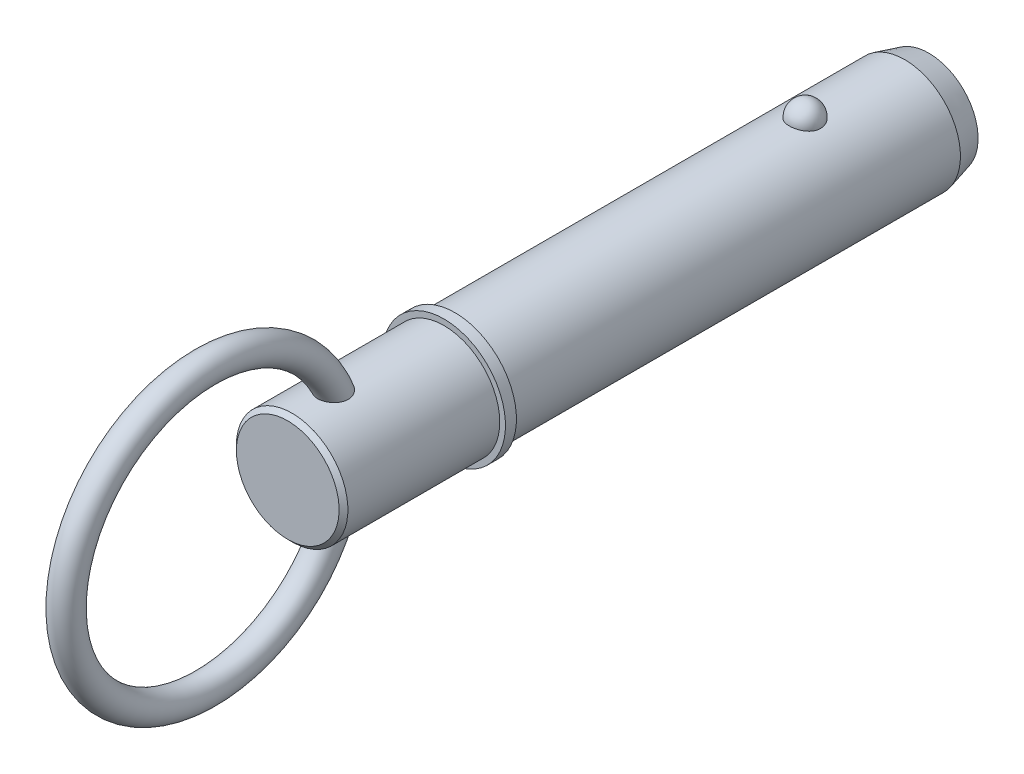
ISO-10303-21;
HEADER;
FILE_DESCRIPTION(('STEP AP214'),'2;1');
FILE_NAME('part.step','',(''),(''),'','','');
FILE_SCHEMA(('AUTOMOTIVE_DESIGN { 1 0 10303 214 1 1 1 1 }'));
ENDSEC;
DATA;
#1=APPLICATION_CONTEXT('core data for automotive mechanical design processes');
#2=APPLICATION_PROTOCOL_DEFINITION('international standard','automotive_design',2000,#1);
#3=PRODUCT_CONTEXT('',#1,'mechanical');
#4=PRODUCT('Part','Part','',(#3));
#5=PRODUCT_RELATED_PRODUCT_CATEGORY('part','',(#4));
#6=PRODUCT_DEFINITION_FORMATION('','',#4);
#7=PRODUCT_DEFINITION_CONTEXT('part definition',#1,'design');
#8=PRODUCT_DEFINITION('design','',#6,#7);
#9=PRODUCT_DEFINITION_SHAPE('','',#8);
#10=(LENGTH_UNIT() NAMED_UNIT(*) SI_UNIT(.MILLI.,.METRE.));
#11=(NAMED_UNIT(*) PLANE_ANGLE_UNIT() SI_UNIT($,.RADIAN.));
#12=(NAMED_UNIT(*) SI_UNIT($,.STERADIAN.) SOLID_ANGLE_UNIT());
#13=UNCERTAINTY_MEASURE_WITH_UNIT(LENGTH_MEASURE(1.E-05),#10,'distance_accuracy_value','');
#14=(GEOMETRIC_REPRESENTATION_CONTEXT(3) GLOBAL_UNCERTAINTY_ASSIGNED_CONTEXT((#13)) GLOBAL_UNIT_ASSIGNED_CONTEXT((#10,
#11,#12)) REPRESENTATION_CONTEXT('',''));
#15=CARTESIAN_POINT('',(0.,0.,0.));
#16=DIRECTION('',(0.,0.,1.));
#17=DIRECTION('',(1.,0.,0.));
#18=AXIS2_PLACEMENT_3D('',#15,#16,#17);
#19=CARTESIAN_POINT('',(0.,0.,76.2));
#20=DIRECTION('',(0.,0.,-1.));
#21=DIRECTION('',(-1.,0.,0.));
#22=AXIS2_PLACEMENT_3D('',#19,#20,#21);
#23=CYLINDRICAL_SURFACE('',#22,12.7);
#24=CARTESIAN_POINT('',(3.52486003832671,12.2010393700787,-3.56));
#25=CARTESIAN_POINT('',(3.52485671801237,12.2010422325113,-3.3610062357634));
#26=CARTESIAN_POINT('',(3.50863187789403,12.2057632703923,-3.16197042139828));
#27=CARTESIAN_POINT('',(3.4441205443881,12.2241207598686,-2.76953945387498));
#28=CARTESIAN_POINT('',(3.39582213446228,12.2377605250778,-2.57614642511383));
#29=CARTESIAN_POINT('',(3.26839193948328,12.2724057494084,-2.20059799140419));
#30=CARTESIAN_POINT('',(3.18927369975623,12.2934079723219,-2.01843769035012));
#31=CARTESIAN_POINT('',(3.00217139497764,12.3404306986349,-1.6703228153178));
#32=CARTESIAN_POINT('',(2.89418796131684,12.3664510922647,-1.50436788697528));
#33=CARTESIAN_POINT('',(2.65144862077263,12.4207616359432,-1.19241975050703));
#34=CARTESIAN_POINT('',(2.51656310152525,12.4490623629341,-1.04652919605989));
#35=CARTESIAN_POINT('',(2.22383249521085,12.5046678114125,-0.779711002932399));
#36=CARTESIAN_POINT('',(2.0659873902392,12.5319725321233,-0.658783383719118));
#37=CARTESIAN_POINT('',(1.73204520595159,12.5824645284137,-0.445586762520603));
#38=CARTESIAN_POINT('',(1.55600183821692,12.6056634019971,-0.353236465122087));
#39=CARTESIAN_POINT('',(1.19021695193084,12.6454411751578,-0.199381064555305));
#40=CARTESIAN_POINT('',(1.00047694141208,12.6620208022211,-0.137872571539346));
#41=CARTESIAN_POINT('',(0.616329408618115,12.6864692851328,-0.0483191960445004));
#42=CARTESIAN_POINT('',(0.422067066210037,12.6944893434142,-0.019692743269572));
#43=CARTESIAN_POINT('',(0.031325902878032,12.7014637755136,0.00524116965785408));
#44=CARTESIAN_POINT('',(-0.165152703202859,12.7004190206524,0.00155173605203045));
#45=CARTESIAN_POINT('',(-0.551780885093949,12.6894611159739,-0.0377454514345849));
#46=CARTESIAN_POINT('',(-0.741980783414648,12.6796749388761,-0.0728962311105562));
#47=CARTESIAN_POINT('',(-1.11361063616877,12.6524544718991,-0.173489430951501));
#48=CARTESIAN_POINT('',(-1.29504043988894,12.6350200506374,-0.238932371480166));
#49=CARTESIAN_POINT('',(-1.64521311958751,12.5942270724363,-0.398772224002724));
#50=CARTESIAN_POINT('',(-1.81387645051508,12.5708347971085,-0.493334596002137));
#51=CARTESIAN_POINT('',(-2.13292959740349,12.5206522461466,-0.708731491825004));
#52=CARTESIAN_POINT('',(-2.28331755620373,12.4938616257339,-0.82956868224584));
#53=CARTESIAN_POINT('',(-2.56470285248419,12.4391828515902,-1.09687144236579));
#54=CARTESIAN_POINT('',(-2.69527522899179,12.4112835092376,-1.24378221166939));
#55=CARTESIAN_POINT('',(-2.93023079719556,12.3579248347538,-1.55763192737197));
#56=CARTESIAN_POINT('',(-3.03461212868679,12.3324656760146,-1.72457229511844));
#57=CARTESIAN_POINT('',(-3.21564423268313,12.2865167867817,-2.07598316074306));
#58=CARTESIAN_POINT('',(-3.29196222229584,12.2660875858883,-2.26063321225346));
#59=CARTESIAN_POINT('',(-3.41323771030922,12.2328979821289,-2.64061334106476));
#60=CARTESIAN_POINT('',(-3.45819611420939,12.2201373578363,-2.83594310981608));
#61=CARTESIAN_POINT('',(-3.51550038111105,12.2037762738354,-3.2308649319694));
#62=CARTESIAN_POINT('',(-3.5279827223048,12.200137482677,-3.43043558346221));
#63=CARTESIAN_POINT('',(-3.52041430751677,12.2023234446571,-3.82890252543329));
#64=CARTESIAN_POINT('',(-3.50036443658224,12.2081479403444,-4.02779883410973));
#65=CARTESIAN_POINT('',(-3.42842010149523,12.2285446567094,-4.41824213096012));
#66=CARTESIAN_POINT('',(-3.37668525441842,12.243073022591,-4.6098208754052));
#67=CARTESIAN_POINT('',(-3.24279085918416,12.2792134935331,-4.98132360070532));
#68=CARTESIAN_POINT('',(-3.16063009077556,12.300825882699,-5.16124711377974));
#69=CARTESIAN_POINT('',(-2.96738224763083,12.3488691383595,-5.5054285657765));
#70=CARTESIAN_POINT('',(-2.85613997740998,12.3753256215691,-5.66959579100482));
#71=CARTESIAN_POINT('',(-2.60773241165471,12.4300386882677,-5.97665065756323));
#72=CARTESIAN_POINT('',(-2.47056612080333,12.458295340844,-6.11953748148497));
#73=CARTESIAN_POINT('',(-2.17327999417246,12.5135827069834,-6.38059312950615));
#74=CARTESIAN_POINT('',(-2.01307652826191,12.5406084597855,-6.49866785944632));
#75=CARTESIAN_POINT('',(-1.67442544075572,12.5902954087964,-6.70609314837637));
#76=CARTESIAN_POINT('',(-1.49597909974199,12.6129569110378,-6.79544572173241));
#77=CARTESIAN_POINT('',(-1.12819666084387,12.6511224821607,-6.94192787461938));
#78=CARTESIAN_POINT('',(-0.939024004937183,12.666712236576,-6.99944518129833));
#79=CARTESIAN_POINT('',(-0.553267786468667,12.6894125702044,-7.08227444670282));
#80=CARTESIAN_POINT('',(-0.356685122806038,12.6965241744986,-7.10759029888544));
#81=CARTESIAN_POINT('',(0.0343320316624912,12.7014305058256,-7.12510946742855));
#82=CARTESIAN_POINT('',(0.22873699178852,12.6993986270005,-7.11792901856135));
#83=CARTESIAN_POINT('',(0.613493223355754,12.6866339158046,-7.07206766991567));
#84=CARTESIAN_POINT('',(0.803844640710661,12.6759013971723,-7.03338790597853));
#85=CARTESIAN_POINT('',(1.17440741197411,12.6469443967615,-6.925834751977));
#86=CARTESIAN_POINT('',(1.35465462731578,12.6287486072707,-6.85707692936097));
#87=CARTESIAN_POINT('',(1.70092526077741,12.5867908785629,-6.69128257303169));
#88=CARTESIAN_POINT('',(1.86694777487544,12.5630285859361,-6.59424424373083));
#89=CARTESIAN_POINT('',(2.18289085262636,12.5120350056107,-6.3727748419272));
#90=CARTESIAN_POINT('',(2.33252391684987,12.4847559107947,-6.24794475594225));
#91=CARTESIAN_POINT('',(2.60889724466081,12.4299457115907,-5.97511730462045));
#92=CARTESIAN_POINT('',(2.73563353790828,12.4024145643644,-5.82711592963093));
#93=CARTESIAN_POINT('',(2.96505559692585,12.3495984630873,-5.50912267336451));
#94=CARTESIAN_POINT('',(3.06728335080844,12.3243610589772,-5.33879227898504));
#95=CARTESIAN_POINT('',(3.24218794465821,12.2795120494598,-4.98295005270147));
#96=CARTESIAN_POINT('',(3.31487538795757,12.2598984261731,-4.79744369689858));
#97=CARTESIAN_POINT('',(3.42255689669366,12.2302435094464,-4.43775244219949));
#98=CARTESIAN_POINT('',(3.46085292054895,12.2193780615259,-4.264615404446));
#99=CARTESIAN_POINT('',(3.5120056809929,12.2047747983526,-3.9143299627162));
#100=CARTESIAN_POINT('',(3.52486299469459,12.2010368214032,-3.73718164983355));
#101=CARTESIAN_POINT('',(3.52486003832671,12.2010393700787,-3.56));
#102=B_SPLINE_CURVE_WITH_KNOTS('',3,(#24,#25,#26,#27,#28,#29,#30,#31,#32,#33,#34,#35,#36,#37,
#38,#39,#40,#41,#42,#43,#44,#45,#46,#47,#48,#49,#50,#51,#52,#53,#54,#55,#56,#57,#58,#59,#60,#61,
#62,#63,#64,#65,#66,#67,#68,#69,#70,#71,#72,#73,#74,#75,#76,#77,#78,#79,#80,#81,#82,#83,#84,#85,
#86,#87,#88,#89,#90,#91,#92,#93,#94,#95,#96,#97,#98,#99,#100,#101),.UNSPECIFIED.,.T.,.F.,(4,2,2,
2,2,2,2,2,2,2,2,2,2,2,2,2,2,2,2,2,2,2,2,2,2,2,2,2,2,2,2,2,2,2,2,2,2,2,4),(0.,0.596344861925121,
1.19291141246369,1.78921606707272,2.38550767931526,2.98474477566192,3.58398233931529,
4.18149920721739,4.77895038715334,5.36566361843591,5.95232045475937,6.53059198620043,
7.10887345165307,7.6905033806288,8.27219236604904,8.86498552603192,9.45782077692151,
10.0574751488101,10.6571122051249,11.2542252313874,11.8513220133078,12.4454353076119,
13.0395724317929,13.636947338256,14.2343451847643,14.8339691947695,15.4335511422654,
16.0256602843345,16.6176978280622,17.1985559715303,17.7793931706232,18.3580179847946,
18.9366795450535,19.5242567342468,20.1119357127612,20.7098642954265,21.3075780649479,
21.8385683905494,22.3695466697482),.UNSPECIFIED.);
#103=CARTESIAN_POINT('',(3.52486003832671,12.2010393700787,-3.56));
#104=VERTEX_POINT('',#103);
#105=EDGE_CURVE('E103',#104,#104,#102,.T.);
#106=ORIENTED_EDGE('',*,*,#105,.T.);
#107=EDGE_LOOP('',(#106));
#108=FACE_BOUND('',#107,.T.);
#109=CARTESIAN_POINT('',(0.,0.,-26.2500000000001));
#110=DIRECTION('',(0.,0.,-1.));
#111=DIRECTION('',(-1.,0.,0.));
#112=AXIS2_PLACEMENT_3D('',#109,#110,#111);
#113=CIRCLE('',#112,12.7);
#114=CARTESIAN_POINT('',(-12.7,0.,-26.2500000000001));
#115=VERTEX_POINT('',#114);
#116=EDGE_CURVE('E111',#115,#115,#113,.F.);
#117=ORIENTED_EDGE('',*,*,#116,.T.);
#118=EDGE_LOOP('',(#117));
#119=FACE_BOUND('',#118,.T.);
#120=CARTESIAN_POINT('',(0.,0.,76.2));
#121=DIRECTION('',(0.,0.,1.));
#122=DIRECTION('',(1.,0.,0.));
#123=AXIS2_PLACEMENT_3D('',#120,#121,#122);
#124=CIRCLE('',#123,12.7);
#125=CARTESIAN_POINT('',(12.7,0.,76.2));
#126=VERTEX_POINT('',#125);
#127=EDGE_CURVE('E109',#126,#126,#124,.T.);
#128=ORIENTED_EDGE('',*,*,#127,.F.);
#129=EDGE_LOOP('',(#128));
#130=FACE_BOUND('',#129,.T.);
#131=ADVANCED_FACE('F39',(#108,#119,#130),#23,.T.);
#132=CARTESIAN_POINT('',(0.,0.,-31.75));
#133=DIRECTION('',(0.,0.,-1.));
#134=DIRECTION('',(-1.,0.,0.));
#135=AXIS2_PLACEMENT_3D('',#132,#133,#134);
#136=PLANE('',#135);
#137=CARTESIAN_POINT('',(0.,0.,-31.75));
#138=DIRECTION('',(0.,0.,-1.));
#139=DIRECTION('',(-1.,0.,0.));
#140=AXIS2_PLACEMENT_3D('',#137,#138,#139);
#141=CIRCLE('',#140,11.2262794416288);
#142=CARTESIAN_POINT('',(-11.2262794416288,0.,-31.75));
#143=VERTEX_POINT('',#142);
#144=EDGE_CURVE('E142',#143,#143,#141,.T.);
#145=ORIENTED_EDGE('',*,*,#144,.T.);
#146=EDGE_LOOP('',(#145));
#147=FACE_BOUND('',#146,.T.);
#148=ADVANCED_FACE('F89',(#147),#136,.T.);
#149=CARTESIAN_POINT('',(0.,0.,-31.75));
#150=DIRECTION('',(0.,0.,1.));
#151=DIRECTION('',(1.,0.,0.));
#152=AXIS2_PLACEMENT_3D('',#149,#150,#151);
#153=CONICAL_SURFACE('',#152,11.2262794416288,0.261799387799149);
#154=ORIENTED_EDGE('',*,*,#116,.F.);
#155=EDGE_LOOP('',(#154));
#156=FACE_BOUND('',#155,.T.);
#157=ORIENTED_EDGE('',*,*,#144,.F.);
#158=EDGE_LOOP('',(#157));
#159=FACE_BOUND('',#158,.T.);
#160=ADVANCED_FACE('F95',(#156,#159),#153,.T.);
#161=CARTESIAN_POINT('',(0.,12.7,-3.56));
#162=DIRECTION('',(0.,1.,0.));
#163=DIRECTION('',(0.,0.,1.));
#164=AXIS2_PLACEMENT_3D('',#161,#162,#163);
#165=SPHERICAL_SURFACE('',#164,3.56);
#166=ORIENTED_EDGE('',*,*,#105,.F.);
#167=EDGE_LOOP('',(#166));
#168=FACE_BOUND('',#167,.T.);
#169=ADVANCED_FACE('F114',(#168),#165,.T.);
#170=CARTESIAN_POINT('',(0.,0.,76.2));
#171=DIRECTION('',(0.,0.,-1.));
#172=DIRECTION('',(-1.,0.,0.));
#173=AXIS2_PLACEMENT_3D('',#170,#171,#172);
#174=PLANE('',#173);
#175=ORIENTED_EDGE('',*,*,#127,.T.);
#176=EDGE_LOOP('',(#175));
#177=FACE_BOUND('',#176,.T.);
#178=CARTESIAN_POINT('',(0.,0.,76.2));
#179=DIRECTION('',(0.,0.,-1.));
#180=DIRECTION('',(-1.,0.,0.));
#181=AXIS2_PLACEMENT_3D('',#178,#179,#180);
#182=CIRCLE('',#181,14.);
#183=CARTESIAN_POINT('',(-14.,0.,76.2));
#184=VERTEX_POINT('',#183);
#185=EDGE_CURVE('E110',#184,#184,#182,.T.);
#186=ORIENTED_EDGE('',*,*,#185,.T.);
#187=EDGE_LOOP('',(#186));
#188=FACE_BOUND('',#187,.T.);
#189=ADVANCED_FACE('F118',(#177,#188),#174,.T.);
#190=CARTESIAN_POINT('',(0.,0.,33.7287874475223));
#191=DIRECTION('',(0.,0.,-1.));
#192=DIRECTION('',(-1.,0.,0.));
#193=AXIS2_PLACEMENT_3D('',#190,#191,#192);
#194=CYLINDRICAL_SURFACE('',#193,14.);
#195=CARTESIAN_POINT('',(0.,0.,78.7));
#196=DIRECTION('',(0.,0.,-1.));
#197=DIRECTION('',(-1.,0.,0.));
#198=AXIS2_PLACEMENT_3D('',#195,#196,#197);
#199=CIRCLE('',#198,14.);
#200=CARTESIAN_POINT('',(-14.,0.,78.7));
#201=VERTEX_POINT('',#200);
#202=EDGE_CURVE('E135',#201,#201,#199,.T.);
#203=ORIENTED_EDGE('',*,*,#202,.T.);
#204=EDGE_LOOP('',(#203));
#205=FACE_BOUND('',#204,.T.);
#206=ORIENTED_EDGE('',*,*,#185,.F.);
#207=EDGE_LOOP('',(#206));
#208=FACE_BOUND('',#207,.T.);
#209=ADVANCED_FACE('F122',(#205,#208),#194,.T.);
#210=CARTESIAN_POINT('',(0.,14.,78.7));
#211=DIRECTION('',(0.,0.,1.));
#212=DIRECTION('',(1.,0.,0.));
#213=AXIS2_PLACEMENT_3D('',#210,#211,#212);
#214=PLANE('',#213);
#215=CARTESIAN_POINT('',(0.,0.,78.7));
#216=DIRECTION('',(0.,0.,1.));
#217=DIRECTION('',(1.,0.,0.));
#218=AXIS2_PLACEMENT_3D('',#215,#216,#217);
#219=CIRCLE('',#218,12.7);
#220=CARTESIAN_POINT('',(12.7,0.,78.7));
#221=VERTEX_POINT('',#220);
#222=EDGE_CURVE('E113',#221,#221,#219,.T.);
#223=ORIENTED_EDGE('',*,*,#222,.F.);
#224=EDGE_LOOP('',(#223));
#225=FACE_BOUND('',#224,.T.);
#226=ORIENTED_EDGE('',*,*,#202,.F.);
#227=EDGE_LOOP('',(#226));
#228=FACE_BOUND('',#227,.T.);
#229=ADVANCED_FACE('F86',(#225,#228),#214,.T.);
#230=CARTESIAN_POINT('',(0.,0.,114.3));
#231=DIRECTION('',(0.,0.,-1.));
#232=DIRECTION('',(-1.,0.,0.));
#233=AXIS2_PLACEMENT_3D('',#230,#231,#232);
#234=CYLINDRICAL_SURFACE('',#233,12.7);
#235=CARTESIAN_POINT('',(-1.22892607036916,-12.6404011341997,100.67119395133));
#236=CARTESIAN_POINT('',(-1.06119922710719,-12.6567092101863,100.604004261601));
#237=CARTESIAN_POINT('',(-0.887663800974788,-12.6701810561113,100.550792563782));
#238=CARTESIAN_POINT('',(-0.53382313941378,-12.6900116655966,100.473419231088));
#239=CARTESIAN_POINT('',(-0.353518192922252,-12.6963707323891,100.4492563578));
#240=CARTESIAN_POINT('',(0.00871153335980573,-12.7012887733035,100.430519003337));
#241=CARTESIAN_POINT('',(0.190636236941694,-12.699848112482,100.435943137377));
#242=CARTESIAN_POINT('',(0.550971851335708,-12.6893231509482,100.476255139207));
#243=CARTESIAN_POINT('',(0.729382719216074,-12.6802387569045,100.51114336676));
#244=CARTESIAN_POINT('',(1.07771687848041,-12.6553960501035,100.609659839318));
#245=CARTESIAN_POINT('',(1.24763507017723,-12.6396337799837,100.673305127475));
#246=CARTESIAN_POINT('',(1.57398922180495,-12.6031560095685,100.827891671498));
#247=CARTESIAN_POINT('',(1.73042571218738,-12.5824407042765,100.918831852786));
#248=CARTESIAN_POINT('',(2.0246476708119,-12.5384554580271,101.125320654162));
#249=CARTESIAN_POINT('',(2.16251370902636,-12.5151974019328,101.24075697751));
#250=CARTESIAN_POINT('',(2.41652917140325,-12.4686447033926,101.493426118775));
#251=CARTESIAN_POINT('',(2.53268123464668,-12.4453500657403,101.630656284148));
#252=CARTESIAN_POINT('',(2.7397169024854,-12.4014166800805,101.92226178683));
#253=CARTESIAN_POINT('',(2.83072997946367,-12.3807646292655,102.076543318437));
#254=CARTESIAN_POINT('',(2.98642630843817,-12.3441356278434,102.398338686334));
#255=CARTESIAN_POINT('',(3.05110876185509,-12.3281588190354,102.565852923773));
#256=CARTESIAN_POINT('',(3.15450336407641,-12.3021148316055,102.912705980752));
#257=CARTESIAN_POINT('',(3.19268116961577,-12.2921697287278,103.092212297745));
#258=CARTESIAN_POINT('',(3.24150148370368,-12.2793848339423,103.455144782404));
#259=CARTESIAN_POINT('',(3.25213515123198,-12.2765473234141,103.638572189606));
#260=CARTESIAN_POINT('',(3.24696781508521,-12.2779158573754,104.018893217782));
#261=CARTESIAN_POINT('',(3.22910261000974,-12.2826719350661,104.215753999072));
#262=CARTESIAN_POINT('',(3.16504953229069,-12.2993299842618,104.60447917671));
#263=CARTESIAN_POINT('',(3.11884966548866,-12.3112349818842,104.796341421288));
#264=CARTESIAN_POINT('',(2.99323123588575,-12.3424162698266,105.192891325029));
#265=CARTESIAN_POINT('',(2.91059577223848,-12.3623844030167,105.396505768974));
#266=CARTESIAN_POINT('',(2.7144744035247,-12.4069229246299,105.788190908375));
#267=CARTESIAN_POINT('',(2.60094970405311,-12.431499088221,105.976241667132));
#268=CARTESIAN_POINT('',(2.40499526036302,-12.4703951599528,106.247470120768));
#269=CARTESIAN_POINT('',(2.3330184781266,-12.4841083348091,106.338407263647));
#270=CARTESIAN_POINT('',(2.18106597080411,-12.5115521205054,106.513320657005));
#271=CARTESIAN_POINT('',(2.10108885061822,-12.5252827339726,106.597295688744));
#272=CARTESIAN_POINT('',(1.84973962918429,-12.5657115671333,106.836779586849));
#273=CARTESIAN_POINT('',(1.66646770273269,-12.5917488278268,106.980526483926));
#274=CARTESIAN_POINT('',(1.33551340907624,-12.6303067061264,107.185856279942));
#275=CARTESIAN_POINT('',(1.19512135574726,-12.6444898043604,107.25902243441));
#276=CARTESIAN_POINT('',(0.903945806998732,-12.6686276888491,107.381586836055));
#277=CARTESIAN_POINT('',(0.75317336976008,-12.6785868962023,107.431009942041));
#278=CARTESIAN_POINT('',(0.4440901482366,-12.6931800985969,107.502942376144));
#279=CARTESIAN_POINT('',(0.285741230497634,-12.6977833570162,107.525296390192));
#280=CARTESIAN_POINT('',(-0.03244918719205,-12.700953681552,107.540724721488));
#281=CARTESIAN_POINT('',(-0.192290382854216,-12.6995219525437,107.533804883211));
#282=CARTESIAN_POINT('',(-0.49382263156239,-12.6912132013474,107.493209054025));
#283=CARTESIAN_POINT('',(-0.635865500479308,-12.6848307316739,107.461962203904));
#284=CARTESIAN_POINT('',(-0.913041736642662,-12.6678986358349,107.377721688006));
#285=CARTESIAN_POINT('',(-1.04817349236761,-12.6573480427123,107.324722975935));
#286=CARTESIAN_POINT('',(-1.31637898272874,-12.6323524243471,107.196233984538));
#287=CARTESIAN_POINT('',(-1.44890088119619,-12.6177203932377,107.119638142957));
#288=CARTESIAN_POINT('',(-1.70162176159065,-12.5861326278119,106.948743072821));
#289=CARTESIAN_POINT('',(-1.82181486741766,-12.569175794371,106.854435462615));
#290=CARTESIAN_POINT('',(-2.06961284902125,-12.5309682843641,106.632665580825));
#291=CARTESIAN_POINT('',(-2.19457628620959,-12.5094982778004,106.50229330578));
#292=CARTESIAN_POINT('',(-2.42503767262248,-12.4668738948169,106.225308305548));
#293=CARTESIAN_POINT('',(-2.53052086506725,-12.4457197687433,106.078683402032));
#294=CARTESIAN_POINT('',(-2.73961150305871,-12.4015349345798,105.743065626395));
#295=CARTESIAN_POINT('',(-2.83895917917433,-12.3789253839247,105.551346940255));
#296=CARTESIAN_POINT('',(-3.00725804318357,-12.3391195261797,105.154405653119));
#297=CARTESIAN_POINT('',(-3.07618857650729,-12.3219268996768,104.949173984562));
#298=CARTESIAN_POINT('',(-3.18528660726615,-12.2942052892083,104.513754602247));
#299=CARTESIAN_POINT('',(-3.22287145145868,-12.2842816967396,104.282855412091));
#300=CARTESIAN_POINT('',(-3.24821271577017,-12.2775854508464,103.934351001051));
#301=CARTESIAN_POINT('',(-3.25148236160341,-12.276719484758,103.817777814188));
#302=CARTESIAN_POINT('',(-3.24729041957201,-12.2778310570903,103.584859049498));
#303=CARTESIAN_POINT('',(-3.23983534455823,-12.2798068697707,103.468513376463));
#304=CARTESIAN_POINT('',(-3.21488959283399,-12.286359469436,103.24622762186));
#305=CARTESIAN_POINT('',(-3.19823165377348,-12.2907201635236,103.140186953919));
#306=CARTESIAN_POINT('',(-3.15537465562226,-12.3017926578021,102.93022257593));
#307=CARTESIAN_POINT('',(-3.12918076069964,-12.3085031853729,102.826297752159));
#308=CARTESIAN_POINT('',(-3.06721568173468,-12.3240904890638,102.621553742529));
#309=CARTESIAN_POINT('',(-3.03144854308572,-12.3329663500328,102.520733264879));
#310=CARTESIAN_POINT('',(-2.95042598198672,-12.3525998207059,102.323171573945));
#311=CARTESIAN_POINT('',(-2.90517160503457,-12.3633572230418,102.226429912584));
#312=CARTESIAN_POINT('',(-2.81116315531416,-12.3850478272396,102.048857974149));
#313=CARTESIAN_POINT('',(-2.76340897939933,-12.3958187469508,101.967476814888));
#314=CARTESIAN_POINT('',(-2.66091958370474,-12.4182228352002,101.809317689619));
#315=CARTESIAN_POINT('',(-2.60618212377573,-12.4298562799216,101.732541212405));
#316=CARTESIAN_POINT('',(-2.49013138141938,-12.4536239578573,101.584278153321));
#317=CARTESIAN_POINT('',(-2.42882150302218,-12.4657579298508,101.512788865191));
#318=CARTESIAN_POINT('',(-2.30002146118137,-12.4901640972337,101.375587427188));
#319=CARTESIAN_POINT('',(-2.23252894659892,-12.5024363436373,101.309877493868));
#320=CARTESIAN_POINT('',(-2.09370795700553,-12.5264205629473,101.186377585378));
#321=CARTESIAN_POINT('',(-2.02252382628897,-12.5381388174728,101.128426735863));
#322=CARTESIAN_POINT('',(-1.87531735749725,-12.5610012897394,101.01889123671));
#323=CARTESIAN_POINT('',(-1.79929316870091,-12.5721452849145,100.967309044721));
#324=CARTESIAN_POINT('',(-1.56485282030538,-12.6042047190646,100.822706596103));
#325=CARTESIAN_POINT('',(-1.39990754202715,-12.6237766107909,100.739687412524));
#326=CARTESIAN_POINT('',(-1.22892607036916,-12.6404011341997,100.67119395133));
#327=B_SPLINE_CURVE_WITH_KNOTS('',3,(#235,#236,#237,#238,#239,#240,#241,#242,#243,#244,#245,
#246,#247,#248,#249,#250,#251,#252,#253,#254,#255,#256,#257,#258,#259,#260,#261,#262,#263,#264,
#265,#266,#267,#268,#269,#270,#271,#272,#273,#274,#275,#276,#277,#278,#279,#280,#281,#282,#283,
#284,#285,#286,#287,#288,#289,#290,#291,#292,#293,#294,#295,#296,#297,#298,#299,#300,#301,#302,
#303,#304,#305,#306,#307,#308,#309,#310,#311,#312,#313,#314,#315,#316,#317,#318,#319,#320,#321,
#322,#323,#324,#325,#326),.UNSPECIFIED.,.T.,.F.,(4,2,2,2,2,2,2,2,2,2,2,2,2,2,2,2,2,2,2,2,2,2,2,
2,2,2,2,2,2,2,2,2,2,2,2,2,2,2,2,2,2,2,2,2,2,4),(0.,0.543509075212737,1.08699497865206,
1.63045544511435,2.17392254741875,2.71771216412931,3.26148037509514,3.8028076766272,
4.34406914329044,4.88248866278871,5.42092451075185,5.96992270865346,6.51909710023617,
7.10988630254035,7.70092576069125,8.36013748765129,9.02018098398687,9.37009147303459,
9.72006308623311,10.4175255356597,10.8925536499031,11.3670833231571,11.844322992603,
12.3214673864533,12.7562647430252,13.1911630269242,13.6507378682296,14.110530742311,
14.6541210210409,15.198121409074,15.8467121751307,16.4957426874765,17.1940750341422,
17.5435132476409,17.8927393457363,18.2145822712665,18.5362511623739,18.8577843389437,
19.1792821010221,19.463832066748,19.7484735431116,20.0329683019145,20.3175717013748,
20.5948148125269,20.8721645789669,21.4262200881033),.UNSPECIFIED.);
#328=CARTESIAN_POINT('',(-1.22892607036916,-12.6404011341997,100.67119395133));
#329=VERTEX_POINT('',#328);
#330=EDGE_CURVE('E10',#329,#329,#327,.T.);
#331=ORIENTED_EDGE('',*,*,#330,.F.);
#332=EDGE_LOOP('',(#331));
#333=FACE_BOUND('',#332,.T.);
#334=CARTESIAN_POINT('',(-1.22892607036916,12.6404011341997,100.67119395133));
#335=CARTESIAN_POINT('',(-1.39512541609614,12.624240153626,100.73776712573));
#336=CARTESIAN_POINT('',(-1.55582432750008,12.6052778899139,100.818153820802));
#337=CARTESIAN_POINT('',(-1.86136954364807,12.5638060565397,101.004658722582));
#338=CARTESIAN_POINT('',(-2.00617769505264,12.5412882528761,101.110836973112));
#339=CARTESIAN_POINT('',(-2.27547906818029,12.4952333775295,101.346103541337));
#340=CARTESIAN_POINT('',(-2.39998742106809,12.4716970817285,101.475174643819));
#341=CARTESIAN_POINT('',(-2.62534229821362,12.4262157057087,101.752623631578));
#342=CARTESIAN_POINT('',(-2.72620384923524,12.4042696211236,101.900989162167));
#343=CARTESIAN_POINT('',(-2.90197976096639,12.3643304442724,102.2126750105));
#344=CARTESIAN_POINT('',(-2.97691335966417,12.346334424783,102.375984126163));
#345=CARTESIAN_POINT('',(-3.09983588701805,12.3160482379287,102.712927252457));
#346=CARTESIAN_POINT('',(-3.14781852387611,12.3037594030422,102.886563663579));
#347=CARTESIAN_POINT('',(-3.21809353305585,12.2855709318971,103.245523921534));
#348=CARTESIAN_POINT('',(-3.23943500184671,12.2799082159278,103.431044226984));
#349=CARTESIAN_POINT('',(-3.2544382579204,12.2759385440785,103.803232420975));
#350=CARTESIAN_POINT('',(-3.24809142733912,12.2776338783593,103.989900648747));
#351=CARTESIAN_POINT('',(-3.20755159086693,12.288291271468,104.377577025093));
#352=CARTESIAN_POINT('',(-3.17081691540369,12.2979162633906,104.578299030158));
#353=CARTESIAN_POINT('',(-3.06845850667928,12.3238513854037,104.971858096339));
#354=CARTESIAN_POINT('',(-3.00281105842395,12.3401670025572,105.164688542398));
#355=CARTESIAN_POINT('',(-2.83560995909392,12.3797223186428,105.559473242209));
#356=CARTESIAN_POINT('',(-2.73085133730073,12.4035339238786,105.760019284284));
#357=CARTESIAN_POINT('',(-2.48976141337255,12.4541651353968,106.140813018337));
#358=CARTESIAN_POINT('',(-2.35343772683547,12.4809840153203,106.321065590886));
#359=CARTESIAN_POINT('',(-2.07683984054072,12.5296806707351,106.62565995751));
#360=CARTESIAN_POINT('',(-1.94129351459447,12.551613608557,106.754283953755));
#361=CARTESIAN_POINT('',(-1.65081707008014,12.5931023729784,106.987836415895));
#362=CARTESIAN_POINT('',(-1.49591505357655,12.6126615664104,107.092798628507));
#363=CARTESIAN_POINT('',(-1.19690065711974,12.6442092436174,107.257788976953));
#364=CARTESIAN_POINT('',(-1.05541267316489,12.6569190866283,107.322418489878));
#365=CARTESIAN_POINT('',(-0.763415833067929,12.6778764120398,107.427638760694));
#366=CARTESIAN_POINT('',(-0.612913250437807,12.6861269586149,107.468246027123));
#367=CARTESIAN_POINT('',(-0.306168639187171,12.697239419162,107.522715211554));
#368=CARTESIAN_POINT('',(-0.14990366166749,12.7000767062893,107.536454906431));
#369=CARTESIAN_POINT('',(0.16255262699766,12.699920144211,107.53569423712));
#370=CARTESIAN_POINT('',(0.318743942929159,12.6969267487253,107.521196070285));
#371=CARTESIAN_POINT('',(0.614555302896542,12.6859231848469,107.467234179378));
#372=CARTESIAN_POINT('',(0.754548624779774,12.6782987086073,107.429687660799));
#373=CARTESIAN_POINT('',(1.02685044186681,12.6591561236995,107.333711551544));
#374=CARTESIAN_POINT('',(1.15915690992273,12.6476369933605,107.275276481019));
#375=CARTESIAN_POINT('',(1.42405861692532,12.6206654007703,107.134988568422));
#376=CARTESIAN_POINT('',(1.55582877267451,12.604971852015,107.051635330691));
#377=CARTESIAN_POINT('',(1.80621935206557,12.571537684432,106.867498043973));
#378=CARTESIAN_POINT('',(1.92483289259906,12.5537960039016,106.766704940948));
#379=CARTESIAN_POINT('',(2.16936918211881,12.5140714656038,106.530174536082));
#380=CARTESIAN_POINT('',(2.29236422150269,12.4919255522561,106.391439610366));
#381=CARTESIAN_POINT('',(2.51762485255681,12.4484835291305,106.097913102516));
#382=CARTESIAN_POINT('',(2.61987416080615,12.4271880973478,105.943109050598));
#383=CARTESIAN_POINT('',(2.8195630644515,12.3835520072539,105.591316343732));
#384=CARTESIAN_POINT('',(2.91268031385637,12.3617361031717,105.391798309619));
#385=CARTESIAN_POINT('',(3.06675738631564,12.3244204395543,104.979898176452));
#386=CARTESIAN_POINT('',(3.12769905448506,12.3089242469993,104.767508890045));
#387=CARTESIAN_POINT('',(3.19410612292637,12.2917937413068,104.437729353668));
#388=CARTESIAN_POINT('',(3.21217746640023,12.2870696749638,104.322917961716));
#389=CARTESIAN_POINT('',(3.23822570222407,12.2802317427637,104.092095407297));
#390=CARTESIAN_POINT('',(3.24620727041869,12.2781166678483,103.97608482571));
#391=CARTESIAN_POINT('',(3.25166839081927,12.2766712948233,103.74381042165));
#392=CARTESIAN_POINT('',(3.24914931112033,12.2773406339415,103.627546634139));
#393=CARTESIAN_POINT('',(3.23325304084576,12.2815367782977,103.395869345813));
#394=CARTESIAN_POINT('',(3.21988260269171,12.2850618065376,103.28045536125));
#395=CARTESIAN_POINT('',(3.18378347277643,12.2944635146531,103.062188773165));
#396=CARTESIAN_POINT('',(3.16203615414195,12.3000921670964,102.959162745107));
#397=CARTESIAN_POINT('',(3.109310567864,12.3135262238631,102.755694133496));
#398=CARTESIAN_POINT('',(3.07833729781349,12.3213304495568,102.65525018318));
#399=CARTESIAN_POINT('',(3.00719503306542,12.3388864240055,102.457882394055));
#400=CARTESIAN_POINT('',(2.9670290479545,12.34863753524,102.360957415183));
#401=CARTESIAN_POINT('',(2.87766260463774,12.3697681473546,102.17155308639));
#402=CARTESIAN_POINT('',(2.82846300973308,12.3811474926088,102.079073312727));
#403=CARTESIAN_POINT('',(2.72718770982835,12.4038233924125,101.909278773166));
#404=CARTESIAN_POINT('',(2.67601025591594,12.4149937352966,101.831409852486));
#405=CARTESIAN_POINT('',(2.56702778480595,12.4379850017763,101.680514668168));
#406=CARTESIAN_POINT('',(2.5092205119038,12.4498061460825,101.607490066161));
#407=CARTESIAN_POINT('',(2.38741431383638,12.4737362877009,101.466915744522));
#408=CARTESIAN_POINT('',(2.32341881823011,12.4858451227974,101.399363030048));
#409=CARTESIAN_POINT('',(2.18967865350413,12.5099935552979,101.270183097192));
#410=CARTESIAN_POINT('',(2.11993188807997,12.5220331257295,101.208558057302));
#411=CARTESIAN_POINT('',(1.90863625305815,12.5565453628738,101.037971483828));
#412=CARTESIAN_POINT('',(1.75996750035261,12.5784460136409,100.937508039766));
#413=CARTESIAN_POINT('',(1.44761854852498,12.6182083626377,100.762748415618));
#414=CARTESIAN_POINT('',(1.28394037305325,12.6360706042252,100.688448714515));
#415=CARTESIAN_POINT('',(0.945887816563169,12.6658634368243,100.567537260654));
#416=CARTESIAN_POINT('',(0.771499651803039,12.6777861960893,100.520962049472));
#417=CARTESIAN_POINT('',(0.417041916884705,12.694390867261,100.456673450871));
#418=CARTESIAN_POINT('',(0.236969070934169,12.6990685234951,100.438977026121));
#419=CARTESIAN_POINT('',(-0.124879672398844,12.7006841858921,100.432829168));
#420=CARTESIAN_POINT('',(-0.306658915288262,12.6975703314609,100.444573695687));
#421=CARTESIAN_POINT('',(-0.66529779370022,12.6838264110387,100.497473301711));
#422=CARTESIAN_POINT('',(-0.84216829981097,12.6732146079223,100.538556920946));
#423=CARTESIAN_POINT('',(-1.0502551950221,12.6565519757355,100.605394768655));
#424=CARTESIAN_POINT('',(-1.08632235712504,12.6535053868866,100.617681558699));
#425=CARTESIAN_POINT('',(-1.15798463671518,12.6471484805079,100.643501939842));
#426=CARTESIAN_POINT('',(-1.19357974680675,12.6438381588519,100.65703555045));
#427=CARTESIAN_POINT('',(-1.22892607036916,12.6404011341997,100.67119395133));
#428=B_SPLINE_CURVE_WITH_KNOTS('',3,(#334,#335,#336,#337,#338,#339,#340,#341,#342,#343,#344,
#345,#346,#347,#348,#349,#350,#351,#352,#353,#354,#355,#356,#357,#358,#359,#360,#361,#362,#363,
#364,#365,#366,#367,#368,#369,#370,#371,#372,#373,#374,#375,#376,#377,#378,#379,#380,#381,#382,
#383,#384,#385,#386,#387,#388,#389,#390,#391,#392,#393,#394,#395,#396,#397,#398,#399,#400,#401,
#402,#403,#404,#405,#406,#407,#408,#409,#410,#411,#412,#413,#414,#415,#416,#417,#418,#419,#420,
#421,#422,#423,#424,#425,#426,#427),.UNSPECIFIED.,.T.,.F.,(4,2,2,2,2,2,2,2,2,2,2,2,2,2,2,2,2,2,
2,2,2,2,2,2,2,2,2,2,2,2,2,2,2,2,2,2,2,2,2,2,2,2,2,2,2,2,4),(0.,0.539146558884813,
1.07956050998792,1.61956978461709,2.15923496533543,2.69849886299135,3.23788860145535,
3.79602631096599,4.35433775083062,4.96471598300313,5.57559579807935,6.2550948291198,
6.93443009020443,7.49671429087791,8.05819140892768,8.52445959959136,8.99040698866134,
9.45846913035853,9.92649485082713,10.3600530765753,10.7937251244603,11.2621204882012,
11.7307597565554,12.2888675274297,12.8474116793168,13.5084064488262,14.1697737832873,
14.5183408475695,14.8667463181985,15.2151063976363,15.5632498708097,15.8791508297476,
16.1948809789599,16.5105079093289,16.826104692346,17.1072964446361,17.3885841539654,
17.669716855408,17.9509524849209,18.490448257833,19.0298713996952,19.5700039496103,
20.1104536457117,20.6545101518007,21.1972460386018,21.3119068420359,21.4265694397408),.UNSPECIFIED.);
#429=CARTESIAN_POINT('',(-1.22892607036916,12.6404011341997,100.67119395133));
#430=VERTEX_POINT('',#429);
#431=EDGE_CURVE('E51',#430,#430,#428,.T.);
#432=ORIENTED_EDGE('',*,*,#431,.F.);
#433=EDGE_LOOP('',(#432));
#434=FACE_BOUND('',#433,.T.);
#435=CARTESIAN_POINT('',(0.,0.,113.3));
#436=DIRECTION('',(0.,0.,-1.));
#437=DIRECTION('',(-1.,0.,0.));
#438=AXIS2_PLACEMENT_3D('',#435,#436,#437);
#439=CIRCLE('',#438,12.7);
#440=CARTESIAN_POINT('',(-12.7,0.,113.3));
#441=VERTEX_POINT('',#440);
#442=EDGE_CURVE('E65',#441,#441,#439,.T.);
#443=ORIENTED_EDGE('',*,*,#442,.T.);
#444=EDGE_LOOP('',(#443));
#445=FACE_BOUND('',#444,.T.);
#446=ORIENTED_EDGE('',*,*,#222,.T.);
#447=EDGE_LOOP('',(#446));
#448=FACE_BOUND('',#447,.T.);
#449=ADVANCED_FACE('F70',(#333,#434,#445,#448),#234,.T.);
#450=CARTESIAN_POINT('',(0.,0.,114.3));
#451=DIRECTION('',(0.,0.,-1.));
#452=DIRECTION('',(-1.,0.,0.));
#453=AXIS2_PLACEMENT_3D('',#450,#451,#452);
#454=PLANE('',#453);
#455=CARTESIAN_POINT('',(0.,0.,114.3));
#456=DIRECTION('',(0.,0.,-1.));
#457=DIRECTION('',(-1.,0.,0.));
#458=AXIS2_PLACEMENT_3D('',#455,#456,#457);
#459=CIRCLE('',#458,11.6999999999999);
#460=CARTESIAN_POINT('',(-11.6999999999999,0.,114.3));
#461=VERTEX_POINT('',#460);
#462=EDGE_CURVE('E58',#461,#461,#459,.F.);
#463=ORIENTED_EDGE('',*,*,#462,.T.);
#464=EDGE_LOOP('',(#463));
#465=FACE_BOUND('',#464,.T.);
#466=ADVANCED_FACE('F77',(#465),#454,.F.);
#467=CARTESIAN_POINT('',(0.,0.,113.3));
#468=DIRECTION('',(0.,0.,-1.));
#469=DIRECTION('',(-1.,0.,0.));
#470=AXIS2_PLACEMENT_3D('',#467,#468,#469);
#471=CONICAL_SURFACE('',#470,12.7,0.785398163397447);
#472=ORIENTED_EDGE('',*,*,#462,.F.);
#473=EDGE_LOOP('',(#472));
#474=FACE_BOUND('',#473,.T.);
#475=ORIENTED_EDGE('',*,*,#442,.F.);
#476=EDGE_LOOP('',(#475));
#477=FACE_BOUND('',#476,.T.);
#478=ADVANCED_FACE('F41',(#474,#477),#471,.T.);
#479=CARTESIAN_POINT('',(0.,0.,133.05));
#480=DIRECTION('',(1.,0.,0.));
#481=DIRECTION('',(0.,0.,-1.));
#482=AXIS2_PLACEMENT_3D('',#479,#480,#481);
#483=TOROIDAL_SURFACE('',#482,31.75,3.25);
#484=ORIENTED_EDGE('',*,*,#330,.T.);
#485=EDGE_LOOP('',(#484));
#486=FACE_BOUND('',#485,.T.);
#487=ORIENTED_EDGE('',*,*,#431,.T.);
#488=EDGE_LOOP('',(#487));
#489=FACE_BOUND('',#488,.T.);
#490=ADVANCED_FACE('F74',(#486,#489),#483,.T.);
#491=CLOSED_SHELL('',(#131,#148,#160,#169,#189,#209,#229,#449,#466,#478,#490));
#492=MANIFOLD_SOLID_BREP('B2',#491);
#493=ADVANCED_BREP_SHAPE_REPRESENTATION('',(#18,#492),#14);
#494=SHAPE_DEFINITION_REPRESENTATION(#9,#493);
ENDSEC;
END-ISO-10303-21;
